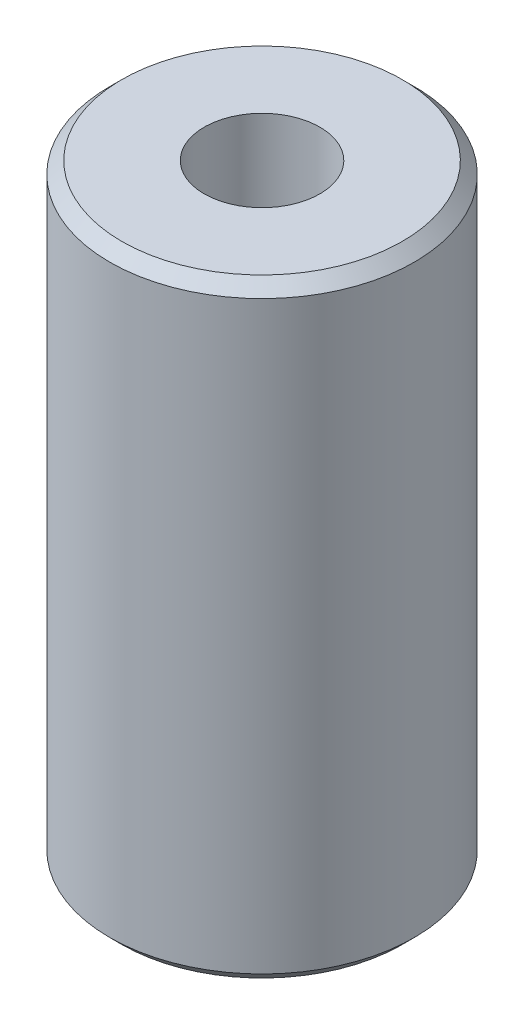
ISO-10303-21;
HEADER;
FILE_DESCRIPTION(('STEP AP214'),'2;1');
FILE_NAME('part.step','',(''),(''),'','','');
FILE_SCHEMA(('AUTOMOTIVE_DESIGN { 1 0 10303 214 1 1 1 1 }'));
ENDSEC;
DATA;
#1=APPLICATION_CONTEXT('core data for automotive mechanical design processes');
#2=APPLICATION_PROTOCOL_DEFINITION('international standard','automotive_design',2000,#1);
#3=PRODUCT_CONTEXT('',#1,'mechanical');
#4=PRODUCT('Part','Part','',(#3));
#5=PRODUCT_RELATED_PRODUCT_CATEGORY('part','',(#4));
#6=PRODUCT_DEFINITION_FORMATION('','',#4);
#7=PRODUCT_DEFINITION_CONTEXT('part definition',#1,'design');
#8=PRODUCT_DEFINITION('design','',#6,#7);
#9=PRODUCT_DEFINITION_SHAPE('','',#8);
#10=(LENGTH_UNIT() NAMED_UNIT(*) SI_UNIT(.MILLI.,.METRE.));
#11=(NAMED_UNIT(*) PLANE_ANGLE_UNIT() SI_UNIT($,.RADIAN.));
#12=(NAMED_UNIT(*) SI_UNIT($,.STERADIAN.) SOLID_ANGLE_UNIT());
#13=UNCERTAINTY_MEASURE_WITH_UNIT(LENGTH_MEASURE(1.E-05),#10,'distance_accuracy_value','');
#14=(GEOMETRIC_REPRESENTATION_CONTEXT(3) GLOBAL_UNCERTAINTY_ASSIGNED_CONTEXT((#13)) GLOBAL_UNIT_ASSIGNED_CONTEXT((#10,
#11,#12)) REPRESENTATION_CONTEXT('',''));
#15=CARTESIAN_POINT('',(0.,0.,0.));
#16=DIRECTION('',(0.,0.,1.));
#17=DIRECTION('',(1.,0.,0.));
#18=AXIS2_PLACEMENT_3D('',#15,#16,#17);
#19=CARTESIAN_POINT('',(0.,-25.4,0.));
#20=DIRECTION('',(0.,1.,0.));
#21=DIRECTION('',(0.,0.,1.));
#22=AXIS2_PLACEMENT_3D('',#19,#20,#21);
#23=CYLINDRICAL_SURFACE('',#22,6.35);
#24=CARTESIAN_POINT('',(0.,-24.9,0.));
#25=DIRECTION('',(0.,1.,0.));
#26=DIRECTION('',(0.,0.,1.));
#27=AXIS2_PLACEMENT_3D('',#24,#25,#26);
#28=CIRCLE('',#27,6.35);
#29=CARTESIAN_POINT('',(0.,-24.9,6.35));
#30=VERTEX_POINT('',#29);
#31=EDGE_CURVE('E40',#30,#30,#28,.T.);
#32=ORIENTED_EDGE('',*,*,#31,.T.);
#33=EDGE_LOOP('',(#32));
#34=FACE_BOUND('',#33,.T.);
#35=CARTESIAN_POINT('',(0.,-0.5,0.));
#36=DIRECTION('',(0.,1.,0.));
#37=DIRECTION('',(0.,0.,1.));
#38=AXIS2_PLACEMENT_3D('',#35,#36,#37);
#39=CIRCLE('',#38,6.35);
#40=CARTESIAN_POINT('',(0.,-0.5,6.35));
#41=VERTEX_POINT('',#40);
#42=EDGE_CURVE('E44',#41,#41,#39,.F.);
#43=ORIENTED_EDGE('',*,*,#42,.T.);
#44=EDGE_LOOP('',(#43));
#45=FACE_BOUND('',#44,.T.);
#46=ADVANCED_FACE('F29',(#34,#45),#23,.T.);
#47=CARTESIAN_POINT('',(0.,-25.4,0.));
#48=DIRECTION('',(0.,1.,0.));
#49=DIRECTION('',(0.,0.,1.));
#50=AXIS2_PLACEMENT_3D('',#47,#48,#49);
#51=PLANE('',#50);
#52=CARTESIAN_POINT('',(0.,-25.4,0.));
#53=DIRECTION('',(0.,1.,0.));
#54=DIRECTION('',(0.,0.,1.));
#55=AXIS2_PLACEMENT_3D('',#52,#53,#54);
#56=CIRCLE('',#55,2.41299999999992);
#57=CARTESIAN_POINT('',(0.,-25.4,2.41299999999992));
#58=VERTEX_POINT('',#57);
#59=EDGE_CURVE('E49',#58,#58,#56,.T.);
#60=ORIENTED_EDGE('',*,*,#59,.T.);
#61=EDGE_LOOP('',(#60));
#62=FACE_BOUND('',#61,.T.);
#63=CARTESIAN_POINT('',(0.,-25.4,0.));
#64=DIRECTION('',(0.,1.,0.));
#65=DIRECTION('',(0.,0.,1.));
#66=AXIS2_PLACEMENT_3D('',#63,#64,#65);
#67=CIRCLE('',#66,5.85);
#68=CARTESIAN_POINT('',(0.,-25.4,5.85));
#69=VERTEX_POINT('',#68);
#70=EDGE_CURVE('E36',#69,#69,#67,.F.);
#71=ORIENTED_EDGE('',*,*,#70,.T.);
#72=EDGE_LOOP('',(#71));
#73=FACE_BOUND('',#72,.T.);
#74=ADVANCED_FACE('F61',(#62,#73),#51,.F.);
#75=CARTESIAN_POINT('',(0.,0.,0.));
#76=DIRECTION('',(0.,1.,0.));
#77=DIRECTION('',(0.,0.,1.));
#78=AXIS2_PLACEMENT_3D('',#75,#76,#77);
#79=PLANE('',#78);
#80=CARTESIAN_POINT('',(0.,0.,0.));
#81=DIRECTION('',(0.,1.,0.));
#82=DIRECTION('',(0.,0.,1.));
#83=AXIS2_PLACEMENT_3D('',#80,#81,#82);
#84=CIRCLE('',#83,2.41299999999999);
#85=CARTESIAN_POINT('',(0.,0.,2.41299999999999));
#86=VERTEX_POINT('',#85);
#87=EDGE_CURVE('E52',#86,#86,#84,.T.);
#88=ORIENTED_EDGE('',*,*,#87,.F.);
#89=EDGE_LOOP('',(#88));
#90=FACE_BOUND('',#89,.T.);
#91=CARTESIAN_POINT('',(0.,0.,0.));
#92=DIRECTION('',(0.,1.,0.));
#93=DIRECTION('',(0.,0.,1.));
#94=AXIS2_PLACEMENT_3D('',#91,#92,#93);
#95=CIRCLE('',#94,5.85);
#96=CARTESIAN_POINT('',(0.,0.,5.85));
#97=VERTEX_POINT('',#96);
#98=EDGE_CURVE('E10',#97,#97,#95,.T.);
#99=ORIENTED_EDGE('',*,*,#98,.T.);
#100=EDGE_LOOP('',(#99));
#101=FACE_BOUND('',#100,.T.);
#102=ADVANCED_FACE('F58',(#90,#101),#79,.T.);
#103=CARTESIAN_POINT('',(0.,-24.9,0.));
#104=DIRECTION('',(0.,1.,0.));
#105=DIRECTION('',(0.,0.,1.));
#106=AXIS2_PLACEMENT_3D('',#103,#104,#105);
#107=CONICAL_SURFACE('',#106,6.35,0.785398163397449);
#108=ORIENTED_EDGE('',*,*,#70,.F.);
#109=EDGE_LOOP('',(#108));
#110=FACE_BOUND('',#109,.T.);
#111=ORIENTED_EDGE('',*,*,#31,.F.);
#112=EDGE_LOOP('',(#111));
#113=FACE_BOUND('',#112,.T.);
#114=ADVANCED_FACE('F60',(#110,#113),#107,.T.);
#115=CARTESIAN_POINT('',(0.,0.,0.));
#116=DIRECTION('',(0.,-1.,0.));
#117=DIRECTION('',(0.,0.,-1.));
#118=AXIS2_PLACEMENT_3D('',#115,#116,#117);
#119=CONICAL_SURFACE('',#118,5.85,0.785398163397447);
#120=ORIENTED_EDGE('',*,*,#42,.F.);
#121=EDGE_LOOP('',(#120));
#122=FACE_BOUND('',#121,.T.);
#123=ORIENTED_EDGE('',*,*,#98,.F.);
#124=EDGE_LOOP('',(#123));
#125=FACE_BOUND('',#124,.T.);
#126=ADVANCED_FACE('F31',(#122,#125),#119,.T.);
#127=CARTESIAN_POINT('',(0.,0.,0.));
#128=DIRECTION('',(0.,1.,0.));
#129=DIRECTION('',(0.,0.,1.));
#130=AXIS2_PLACEMENT_3D('',#127,#128,#129);
#131=CYLINDRICAL_SURFACE('',#130,2.41299999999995);
#132=ORIENTED_EDGE('',*,*,#59,.F.);
#133=EDGE_LOOP('',(#132));
#134=FACE_BOUND('',#133,.T.);
#135=ORIENTED_EDGE('',*,*,#87,.T.);
#136=EDGE_LOOP('',(#135));
#137=FACE_BOUND('',#136,.T.);
#138=ADVANCED_FACE('F56',(#134,#137),#131,.F.);
#139=CLOSED_SHELL('',(#46,#74,#102,#114,#126,#138));
#140=MANIFOLD_SOLID_BREP('B2',#139);
#141=ADVANCED_BREP_SHAPE_REPRESENTATION('',(#18,#140),#14);
#142=SHAPE_DEFINITION_REPRESENTATION(#9,#141);
ENDSEC;
END-ISO-10303-21;
